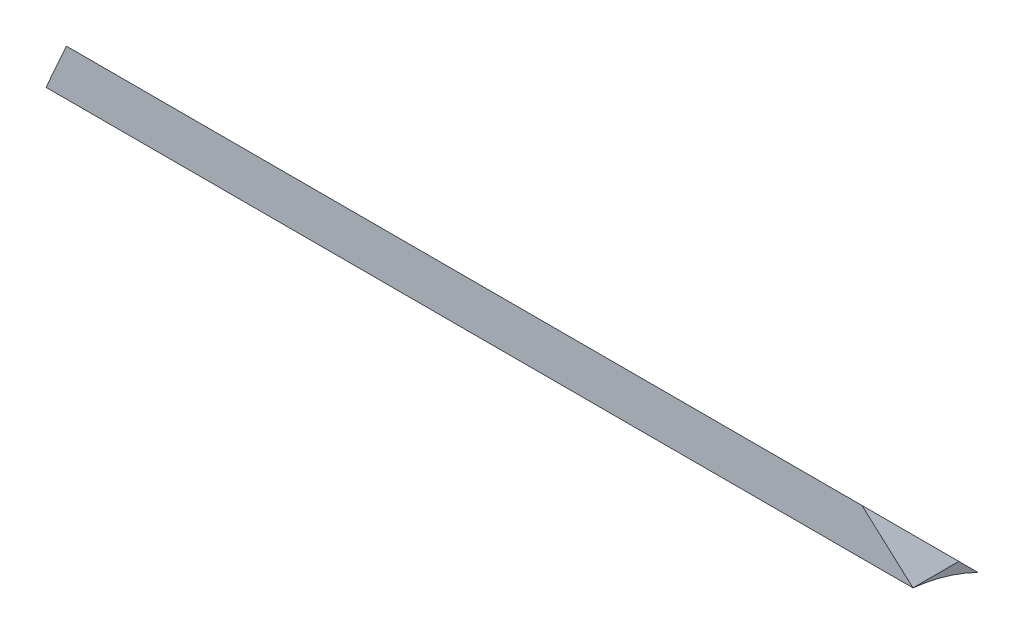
from build123d import *

# Parameters (mm, degrees)
SKETCH1_W          = 127
SKETCH1_H          = 12.7
EXTRUDE1_DEPTH     = 12.7
CUT_EXTRUDE1_DEPTH = 129.263712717
CUT_EXTRUDE2_DEPTH = 129.263712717
SKETCH5_OUTSIDE_W  = 154.542
SKETCH5_OUTSIDE_H  = 37.067
CUT_EXTRUDE6_DEPTH = 128.988341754


with BuildPart() as part:
    # Sketch1 → Extrude1 (new body)
    with BuildSketch(Plane(origin=(0, 0, 0), x_dir=(1, 0, 0), z_dir=(0, 1, 0))):
        with Locations((63.5, 6.35)):
            Rectangle(SKETCH1_W, SKETCH1_H)
    extrude(amount=EXTRUDE1_DEPTH)

    # Sketch2 → Cut-Extrude1 (cut, through all)
    with BuildSketch(Plane(origin=(127, 0, 0), x_dir=(0, 0, -1), z_dir=(1, 0, 0))):
        Polygon((0, 12.7), (12.7, 0), (12.7, 12.7), align=None)
    extrude(amount=-CUT_EXTRUDE1_DEPTH, mode=Mode.SUBTRACT)

    # Sketch3 → Cut-Extrude2 (cut, through all)
    with BuildSketch(Plane(origin=(127, 0, 0), x_dir=(0, 0, -1), z_dir=(1, 0, 0))):
        with BuildLine():
            Line((0, 2.977331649), (0, 19.320393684))
            Line((0, 19.320393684), (3.175, 19.320393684))
            Line((3.175, 19.320393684), (3.175, 2.800394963))
            ThreePointArc((3.175, 2.800394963), (-1.589963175, -54.128399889), (0, 2.977331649))
        make_face()
    extrude(amount=-CUT_EXTRUDE2_DEPTH, mode=Mode.SUBTRACT)

    # Sketch5 outside → Cut-Extrude6 (cut, through all)
    with BuildSketch(Plane.XY):
        with Locations((63.5, 4.7625)):
            Rectangle(SKETCH5_OUTSIDE_W, SKETCH5_OUTSIDE_H)
        Polygon((127, 0), (127, 2.800394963), (63.5, 59.950394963), (25.4, 59.950394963), (0, 2.800394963), (0, 0), align=None, mode=Mode.SUBTRACT)
    extrude(amount=-CUT_EXTRUDE6_DEPTH, mode=Mode.SUBTRACT)


solid = part.part
